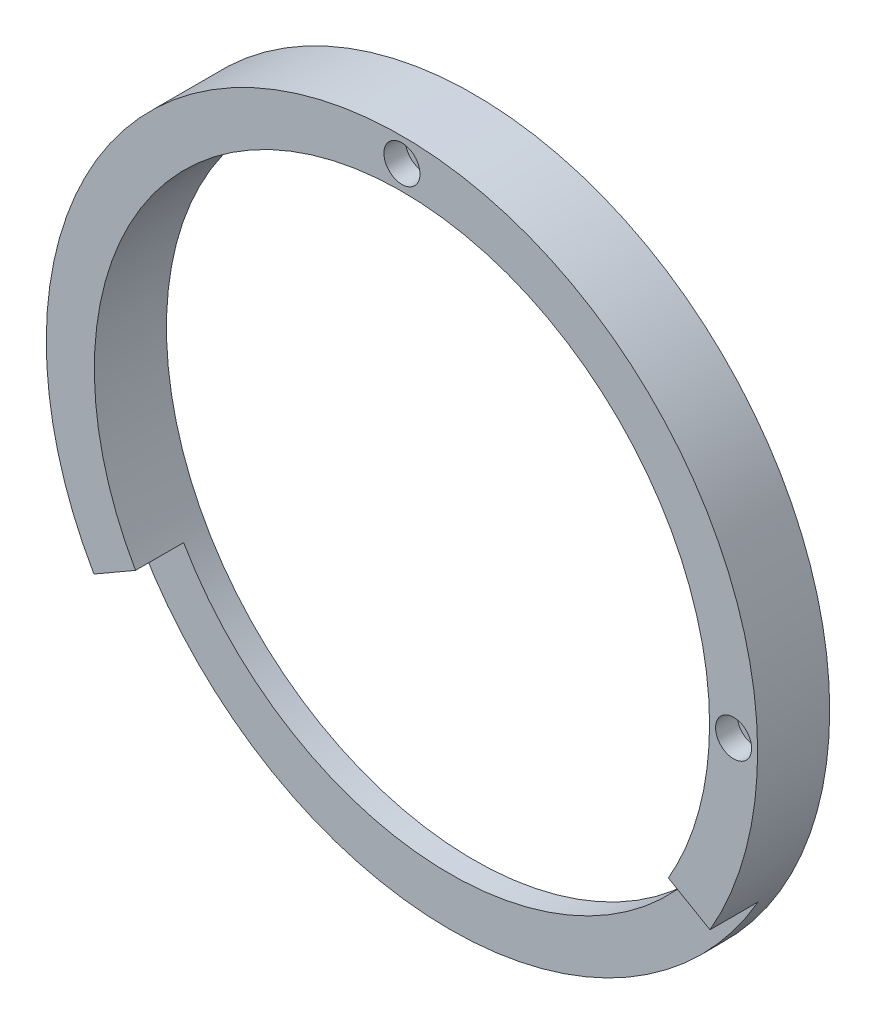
ISO-10303-21;
HEADER;
FILE_DESCRIPTION(('STEP AP214'),'2;1');
FILE_NAME('part.step','',(''),(''),'','','');
FILE_SCHEMA(('AUTOMOTIVE_DESIGN { 1 0 10303 214 1 1 1 1 }'));
ENDSEC;
DATA;
#1=APPLICATION_CONTEXT('core data for automotive mechanical design processes');
#2=APPLICATION_PROTOCOL_DEFINITION('international standard','automotive_design',2000,#1);
#3=PRODUCT_CONTEXT('',#1,'mechanical');
#4=PRODUCT('Part','Part','',(#3));
#5=PRODUCT_RELATED_PRODUCT_CATEGORY('part','',(#4));
#6=PRODUCT_DEFINITION_FORMATION('','',#4);
#7=PRODUCT_DEFINITION_CONTEXT('part definition',#1,'design');
#8=PRODUCT_DEFINITION('design','',#6,#7);
#9=PRODUCT_DEFINITION_SHAPE('','',#8);
#10=(LENGTH_UNIT() NAMED_UNIT(*) SI_UNIT(.MILLI.,.METRE.));
#11=(NAMED_UNIT(*) PLANE_ANGLE_UNIT() SI_UNIT($,.RADIAN.));
#12=(NAMED_UNIT(*) SI_UNIT($,.STERADIAN.) SOLID_ANGLE_UNIT());
#13=UNCERTAINTY_MEASURE_WITH_UNIT(LENGTH_MEASURE(1.E-05),#10,'distance_accuracy_value','');
#14=(GEOMETRIC_REPRESENTATION_CONTEXT(3) GLOBAL_UNCERTAINTY_ASSIGNED_CONTEXT((#13)) GLOBAL_UNIT_ASSIGNED_CONTEXT((#10,
#11,#12)) REPRESENTATION_CONTEXT('',''));
#15=CARTESIAN_POINT('',(0.,0.,0.));
#16=DIRECTION('',(0.,0.,1.));
#17=DIRECTION('',(1.,0.,0.));
#18=AXIS2_PLACEMENT_3D('',#15,#16,#17);
#19=CARTESIAN_POINT('',(-2.22044604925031E-13,69.,0.));
#20=DIRECTION('',(0.,0.,1.));
#21=DIRECTION('',(0.,1.,0.));
#22=AXIS2_PLACEMENT_3D('',#19,#20,#21);
#23=CYLINDRICAL_SURFACE('',#22,2.25);
#24=CARTESIAN_POINT('',(-2.22044604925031E-13,69.,0.));
#25=DIRECTION('',(0.,0.,1.));
#26=DIRECTION('',(0.,1.,0.));
#27=AXIS2_PLACEMENT_3D('',#24,#25,#26);
#28=CIRCLE('',#27,2.25);
#29=CARTESIAN_POINT('',(-2.29900442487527E-13,71.25,0.));
#30=VERTEX_POINT('',#29);
#31=EDGE_CURVE('E113',#30,#30,#28,.T.);
#32=ORIENTED_EDGE('',*,*,#31,.F.);
#33=EDGE_LOOP('',(#32));
#34=FACE_BOUND('',#33,.T.);
#35=CARTESIAN_POINT('',(-2.22044604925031E-13,69.,10.5));
#36=DIRECTION('',(0.,0.,1.));
#37=DIRECTION('',(1.,0.,0.));
#38=AXIS2_PLACEMENT_3D('',#35,#36,#37);
#39=CIRCLE('',#38,2.25);
#40=CARTESIAN_POINT('',(2.24999999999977,69.,10.5));
#41=VERTEX_POINT('',#40);
#42=EDGE_CURVE('E40',#41,#41,#39,.F.);
#43=ORIENTED_EDGE('',*,*,#42,.F.);
#44=EDGE_LOOP('',(#43));
#45=FACE_BOUND('',#44,.T.);
#46=ADVANCED_FACE('F36',(#34,#45),#23,.F.);
#47=CARTESIAN_POINT('',(69.,0.,0.));
#48=DIRECTION('',(0.,0.,1.));
#49=DIRECTION('',(1.,0.,0.));
#50=AXIS2_PLACEMENT_3D('',#47,#48,#49);
#51=CYLINDRICAL_SURFACE('',#50,2.25);
#52=CARTESIAN_POINT('',(69.,0.,0.));
#53=DIRECTION('',(0.,0.,1.));
#54=DIRECTION('',(1.,0.,0.));
#55=AXIS2_PLACEMENT_3D('',#52,#53,#54);
#56=CIRCLE('',#55,2.25);
#57=CARTESIAN_POINT('',(71.25,0.,0.));
#58=VERTEX_POINT('',#57);
#59=EDGE_CURVE('E97',#58,#58,#56,.T.);
#60=ORIENTED_EDGE('',*,*,#59,.F.);
#61=EDGE_LOOP('',(#60));
#62=FACE_BOUND('',#61,.T.);
#63=CARTESIAN_POINT('',(69.,0.,10.5));
#64=DIRECTION('',(0.,0.,1.));
#65=DIRECTION('',(1.,0.,0.));
#66=AXIS2_PLACEMENT_3D('',#63,#64,#65);
#67=CIRCLE('',#66,2.25);
#68=CARTESIAN_POINT('',(71.25,0.,10.5));
#69=VERTEX_POINT('',#68);
#70=EDGE_CURVE('E111',#69,#69,#67,.F.);
#71=ORIENTED_EDGE('',*,*,#70,.F.);
#72=EDGE_LOOP('',(#71));
#73=FACE_BOUND('',#72,.T.);
#74=ADVANCED_FACE('F155',(#62,#73),#51,.F.);
#75=CARTESIAN_POINT('',(0.,0.,15.));
#76=DIRECTION('',(0.,0.,-1.));
#77=DIRECTION('',(-1.,0.,0.));
#78=AXIS2_PLACEMENT_3D('',#75,#76,#77);
#79=CYLINDRICAL_SURFACE('',#78,74.);
#80=CARTESIAN_POINT('',(0.,0.,5.));
#81=DIRECTION('',(0.,0.,1.));
#82=DIRECTION('',(1.,0.,0.));
#83=AXIS2_PLACEMENT_3D('',#80,#81,#82);
#84=CIRCLE('',#83,74.);
#85=CARTESIAN_POINT('',(-64.0858798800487,-36.9999999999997,5.00000000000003));
#86=VERTEX_POINT('',#85);
#87=CARTESIAN_POINT('',(64.0858798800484,-37.0000000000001,5.00000000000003));
#88=VERTEX_POINT('',#87);
#89=EDGE_CURVE('E100',#86,#88,#84,.T.);
#90=ORIENTED_EDGE('',*,*,#89,.F.);
#91=DIRECTION('',(0.,0.,1.));
#92=VECTOR('',#91,1.);
#93=CARTESIAN_POINT('',(-64.0858798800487,-36.9999999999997,5.00000000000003));
#94=LINE('',#93,#92);
#95=CARTESIAN_POINT('',(-64.0858798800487,-36.9999999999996,15.));
#96=VERTEX_POINT('',#95);
#97=EDGE_CURVE('E61',#86,#96,#94,.T.);
#98=ORIENTED_EDGE('',*,*,#97,.T.);
#99=CARTESIAN_POINT('',(0.,0.,15.));
#100=DIRECTION('',(0.,0.,1.));
#101=DIRECTION('',(1.,0.,0.));
#102=AXIS2_PLACEMENT_3D('',#99,#100,#101);
#103=CIRCLE('',#102,74.);
#104=CARTESIAN_POINT('',(64.0858798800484,-37.0000000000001,15.));
#105=VERTEX_POINT('',#104);
#106=EDGE_CURVE('E11',#105,#96,#103,.T.);
#107=ORIENTED_EDGE('',*,*,#106,.F.);
#108=DIRECTION('',(0.,0.,1.));
#109=VECTOR('',#108,1.);
#110=CARTESIAN_POINT('',(64.0858798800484,-37.0000000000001,5.00000000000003));
#111=LINE('',#110,#109);
#112=EDGE_CURVE('E79',#88,#105,#111,.T.);
#113=ORIENTED_EDGE('',*,*,#112,.F.);
#114=EDGE_LOOP('',(#90,#98,#107,#113));
#115=FACE_BOUND('',#114,.T.);
#116=CARTESIAN_POINT('',(0.,0.,0.));
#117=DIRECTION('',(0.,0.,1.));
#118=DIRECTION('',(1.,0.,0.));
#119=AXIS2_PLACEMENT_3D('',#116,#117,#118);
#120=CIRCLE('',#119,74.);
#121=CARTESIAN_POINT('',(74.,0.,0.));
#122=VERTEX_POINT('',#121);
#123=EDGE_CURVE('E45',#122,#122,#120,.T.);
#124=ORIENTED_EDGE('',*,*,#123,.T.);
#125=EDGE_LOOP('',(#124));
#126=FACE_BOUND('',#125,.T.);
#127=ADVANCED_FACE('F38',(#115,#126),#79,.T.);
#128=CARTESIAN_POINT('',(0.,0.,15.));
#129=DIRECTION('',(0.,0.,1.));
#130=DIRECTION('',(1.,0.,0.));
#131=AXIS2_PLACEMENT_3D('',#128,#129,#130);
#132=PLANE('',#131);
#133=CARTESIAN_POINT('',(-1.11022302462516E-13,69.,15.));
#134=DIRECTION('',(0.,0.,1.));
#135=DIRECTION('',(0.,1.,0.));
#136=AXIS2_PLACEMENT_3D('',#133,#134,#135);
#137=CIRCLE('',#136,3.75000000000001);
#138=CARTESIAN_POINT('',(-1.24115365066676E-13,72.75,15.));
#139=VERTEX_POINT('',#138);
#140=EDGE_CURVE('E187',#139,#139,#137,.T.);
#141=ORIENTED_EDGE('',*,*,#140,.F.);
#142=EDGE_LOOP('',(#141));
#143=FACE_BOUND('',#142,.T.);
#144=CARTESIAN_POINT('',(69.,0.,15.));
#145=DIRECTION('',(0.,0.,1.));
#146=DIRECTION('',(1.,0.,0.));
#147=AXIS2_PLACEMENT_3D('',#144,#145,#146);
#148=CIRCLE('',#147,3.75000000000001);
#149=CARTESIAN_POINT('',(72.75,0.,15.));
#150=VERTEX_POINT('',#149);
#151=EDGE_CURVE('E120',#150,#150,#148,.T.);
#152=ORIENTED_EDGE('',*,*,#151,.F.);
#153=EDGE_LOOP('',(#152));
#154=FACE_BOUND('',#153,.T.);
#155=DIRECTION('',(-0.866025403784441,-0.499999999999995,0.));
#156=VECTOR('',#155,1.);
#157=CARTESIAN_POINT('',(-55.4256258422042,-31.9999999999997,15.));
#158=LINE('',#157,#156);
#159=CARTESIAN_POINT('',(-55.4256258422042,-31.9999999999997,15.));
#160=VERTEX_POINT('',#159);
#161=EDGE_CURVE('E96',#160,#96,#158,.T.);
#162=ORIENTED_EDGE('',*,*,#161,.F.);
#163=CARTESIAN_POINT('',(0.,0.,15.));
#164=DIRECTION('',(0.,0.,1.));
#165=DIRECTION('',(1.,0.,0.));
#166=AXIS2_PLACEMENT_3D('',#163,#164,#165);
#167=CIRCLE('',#166,64.);
#168=CARTESIAN_POINT('',(55.4256258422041,-32.,15.));
#169=VERTEX_POINT('',#168);
#170=EDGE_CURVE('E95',#169,#160,#167,.T.);
#171=ORIENTED_EDGE('',*,*,#170,.F.);
#172=DIRECTION('',(0.866025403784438,-0.500000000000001,0.));
#173=VECTOR('',#172,1.);
#174=CARTESIAN_POINT('',(55.4256258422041,-32.,15.));
#175=LINE('',#174,#173);
#176=EDGE_CURVE('E82',#169,#105,#175,.T.);
#177=ORIENTED_EDGE('',*,*,#176,.T.);
#178=ORIENTED_EDGE('',*,*,#106,.T.);
#179=EDGE_LOOP('',(#162,#171,#177,#178));
#180=FACE_BOUND('',#179,.T.);
#181=ADVANCED_FACE('F93',(#143,#154,#180),#132,.T.);
#182=CARTESIAN_POINT('',(0.,0.,0.));
#183=DIRECTION('',(0.,0.,1.));
#184=DIRECTION('',(1.,0.,0.));
#185=AXIS2_PLACEMENT_3D('',#182,#183,#184);
#186=PLANE('',#185);
#187=ORIENTED_EDGE('',*,*,#31,.T.);
#188=EDGE_LOOP('',(#187));
#189=FACE_BOUND('',#188,.T.);
#190=ORIENTED_EDGE('',*,*,#59,.T.);
#191=EDGE_LOOP('',(#190));
#192=FACE_BOUND('',#191,.T.);
#193=CARTESIAN_POINT('',(0.,0.,0.));
#194=DIRECTION('',(0.,0.,1.));
#195=DIRECTION('',(1.,0.,0.));
#196=AXIS2_PLACEMENT_3D('',#193,#194,#195);
#197=CIRCLE('',#196,64.);
#198=CARTESIAN_POINT('',(64.,0.,0.));
#199=VERTEX_POINT('',#198);
#200=EDGE_CURVE('E103',#199,#199,#197,.T.);
#201=ORIENTED_EDGE('',*,*,#200,.T.);
#202=EDGE_LOOP('',(#201));
#203=FACE_BOUND('',#202,.T.);
#204=ORIENTED_EDGE('',*,*,#123,.F.);
#205=EDGE_LOOP('',(#204));
#206=FACE_BOUND('',#205,.T.);
#207=ADVANCED_FACE('F149',(#189,#192,#203,#206),#186,.F.);
#208=CARTESIAN_POINT('',(0.,0.,0.));
#209=DIRECTION('',(0.,0.,1.));
#210=DIRECTION('',(1.,0.,0.));
#211=AXIS2_PLACEMENT_3D('',#208,#209,#210);
#212=CYLINDRICAL_SURFACE('',#211,64.);
#213=ORIENTED_EDGE('',*,*,#200,.F.);
#214=EDGE_LOOP('',(#213));
#215=FACE_BOUND('',#214,.T.);
#216=ORIENTED_EDGE('',*,*,#170,.T.);
#217=DIRECTION('',(0.,0.,1.));
#218=VECTOR('',#217,1.);
#219=CARTESIAN_POINT('',(-55.4256258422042,-31.9999999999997,5.));
#220=LINE('',#219,#218);
#221=CARTESIAN_POINT('',(-55.4256258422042,-31.9999999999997,5.));
#222=VERTEX_POINT('',#221);
#223=EDGE_CURVE('E101',#222,#160,#220,.T.);
#224=ORIENTED_EDGE('',*,*,#223,.F.);
#225=CARTESIAN_POINT('',(0.,0.,5.));
#226=DIRECTION('',(0.,0.,1.));
#227=DIRECTION('',(1.,0.,0.));
#228=AXIS2_PLACEMENT_3D('',#225,#226,#227);
#229=CIRCLE('',#228,64.);
#230=CARTESIAN_POINT('',(55.4256258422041,-32.0000000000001,5.));
#231=VERTEX_POINT('',#230);
#232=EDGE_CURVE('E133',#222,#231,#229,.T.);
#233=ORIENTED_EDGE('',*,*,#232,.T.);
#234=DIRECTION('',(0.,0.,1.));
#235=VECTOR('',#234,1.);
#236=CARTESIAN_POINT('',(55.4256258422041,-32.0000000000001,5.));
#237=LINE('',#236,#235);
#238=EDGE_CURVE('E87',#231,#169,#237,.T.);
#239=ORIENTED_EDGE('',*,*,#238,.T.);
#240=EDGE_LOOP('',(#216,#224,#233,#239));
#241=FACE_BOUND('',#240,.T.);
#242=ADVANCED_FACE('F137',(#215,#241),#212,.F.);
#243=CARTESIAN_POINT('',(-55.4256258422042,-31.9999999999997,5.));
#244=DIRECTION('',(-0.499999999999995,0.866025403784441,0.));
#245=DIRECTION('',(-0.866025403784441,-0.499999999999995,0.));
#246=AXIS2_PLACEMENT_3D('',#243,#244,#245);
#247=PLANE('',#246);
#248=ORIENTED_EDGE('',*,*,#223,.T.);
#249=ORIENTED_EDGE('',*,*,#161,.T.);
#250=ORIENTED_EDGE('',*,*,#97,.F.);
#251=DIRECTION('',(-0.866025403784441,-0.499999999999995,0.));
#252=VECTOR('',#251,1.);
#253=CARTESIAN_POINT('',(-55.4256258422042,-31.9999999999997,5.));
#254=LINE('',#253,#252);
#255=EDGE_CURVE('E88',#222,#86,#254,.T.);
#256=ORIENTED_EDGE('',*,*,#255,.F.);
#257=EDGE_LOOP('',(#248,#249,#250,#256));
#258=FACE_BOUND('',#257,.T.);
#259=ADVANCED_FACE('F140',(#258),#247,.F.);
#260=CARTESIAN_POINT('',(55.4256258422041,-32.0000000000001,5.));
#261=DIRECTION('',(-0.500000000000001,-0.866025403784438,0.));
#262=DIRECTION('',(0.866025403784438,-0.500000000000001,0.));
#263=AXIS2_PLACEMENT_3D('',#260,#261,#262);
#264=PLANE('',#263);
#265=DIRECTION('',(0.866025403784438,-0.500000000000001,0.));
#266=VECTOR('',#265,1.);
#267=CARTESIAN_POINT('',(55.4256258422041,-32.0000000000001,5.));
#268=LINE('',#267,#266);
#269=EDGE_CURVE('E53',#231,#88,#268,.T.);
#270=ORIENTED_EDGE('',*,*,#269,.T.);
#271=ORIENTED_EDGE('',*,*,#112,.T.);
#272=ORIENTED_EDGE('',*,*,#176,.F.);
#273=ORIENTED_EDGE('',*,*,#238,.F.);
#274=EDGE_LOOP('',(#270,#271,#272,#273));
#275=FACE_BOUND('',#274,.T.);
#276=ADVANCED_FACE('F81',(#275),#264,.T.);
#277=CARTESIAN_POINT('',(0.,0.,5.));
#278=DIRECTION('',(0.,0.,1.));
#279=DIRECTION('',(1.,0.,0.));
#280=AXIS2_PLACEMENT_3D('',#277,#278,#279);
#281=PLANE('',#280);
#282=ORIENTED_EDGE('',*,*,#89,.T.);
#283=ORIENTED_EDGE('',*,*,#269,.F.);
#284=ORIENTED_EDGE('',*,*,#232,.F.);
#285=ORIENTED_EDGE('',*,*,#255,.T.);
#286=EDGE_LOOP('',(#282,#283,#284,#285));
#287=FACE_BOUND('',#286,.T.);
#288=ADVANCED_FACE('F139',(#287),#281,.T.);
#289=CARTESIAN_POINT('',(69.,0.,10.5));
#290=DIRECTION('',(0.,0.,1.));
#291=DIRECTION('',(1.,0.,0.));
#292=AXIS2_PLACEMENT_3D('',#289,#290,#291);
#293=PLANE('',#292);
#294=CARTESIAN_POINT('',(69.,0.,10.5));
#295=DIRECTION('',(0.,0.,1.));
#296=DIRECTION('',(1.,0.,0.));
#297=AXIS2_PLACEMENT_3D('',#294,#295,#296);
#298=CIRCLE('',#297,3.75000000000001);
#299=CARTESIAN_POINT('',(72.75,0.,10.5));
#300=VERTEX_POINT('',#299);
#301=EDGE_CURVE('E114',#300,#300,#298,.T.);
#302=ORIENTED_EDGE('',*,*,#301,.T.);
#303=EDGE_LOOP('',(#302));
#304=FACE_BOUND('',#303,.T.);
#305=ORIENTED_EDGE('',*,*,#70,.T.);
#306=EDGE_LOOP('',(#305));
#307=FACE_BOUND('',#306,.T.);
#308=ADVANCED_FACE('F148',(#304,#307),#293,.T.);
#309=CARTESIAN_POINT('',(69.,0.,10.5));
#310=DIRECTION('',(0.,0.,1.));
#311=DIRECTION('',(1.,0.,0.));
#312=AXIS2_PLACEMENT_3D('',#309,#310,#311);
#313=CYLINDRICAL_SURFACE('',#312,3.75000000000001);
#314=ORIENTED_EDGE('',*,*,#301,.F.);
#315=EDGE_LOOP('',(#314));
#316=FACE_BOUND('',#315,.T.);
#317=ORIENTED_EDGE('',*,*,#151,.T.);
#318=EDGE_LOOP('',(#317));
#319=FACE_BOUND('',#318,.T.);
#320=ADVANCED_FACE('F166',(#316,#319),#313,.F.);
#321=CARTESIAN_POINT('',(-2.22044604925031E-13,69.,10.5));
#322=DIRECTION('',(0.,0.,1.));
#323=DIRECTION('',(0.,1.,0.));
#324=AXIS2_PLACEMENT_3D('',#321,#322,#323);
#325=PLANE('',#324);
#326=CARTESIAN_POINT('',(-2.22044604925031E-13,69.,10.5));
#327=DIRECTION('',(0.,0.,1.));
#328=DIRECTION('',(0.,1.,0.));
#329=AXIS2_PLACEMENT_3D('',#326,#327,#328);
#330=CIRCLE('',#329,3.75000000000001);
#331=CARTESIAN_POINT('',(-2.35137667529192E-13,72.7500000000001,10.5));
#332=VERTEX_POINT('',#331);
#333=EDGE_CURVE('E184',#332,#332,#330,.T.);
#334=ORIENTED_EDGE('',*,*,#333,.T.);
#335=EDGE_LOOP('',(#334));
#336=FACE_BOUND('',#335,.T.);
#337=ORIENTED_EDGE('',*,*,#42,.T.);
#338=EDGE_LOOP('',(#337));
#339=FACE_BOUND('',#338,.T.);
#340=ADVANCED_FACE('F169',(#336,#339),#325,.T.);
#341=CARTESIAN_POINT('',(-2.22044604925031E-13,69.,10.5));
#342=DIRECTION('',(0.,0.,1.));
#343=DIRECTION('',(0.,1.,0.));
#344=AXIS2_PLACEMENT_3D('',#341,#342,#343);
#345=CYLINDRICAL_SURFACE('',#344,3.75000000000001);
#346=ORIENTED_EDGE('',*,*,#333,.F.);
#347=EDGE_LOOP('',(#346));
#348=FACE_BOUND('',#347,.T.);
#349=ORIENTED_EDGE('',*,*,#140,.T.);
#350=EDGE_LOOP('',(#349));
#351=FACE_BOUND('',#350,.T.);
#352=ADVANCED_FACE('F175',(#348,#351),#345,.F.);
#353=CLOSED_SHELL('',(#46,#74,#127,#181,#207,#242,#259,#276,#288,#308,#320,#340,#352));
#354=MANIFOLD_SOLID_BREP('B2',#353);
#355=ADVANCED_BREP_SHAPE_REPRESENTATION('',(#18,#354),#14);
#356=SHAPE_DEFINITION_REPRESENTATION(#9,#355);
ENDSEC;
END-ISO-10303-21;
